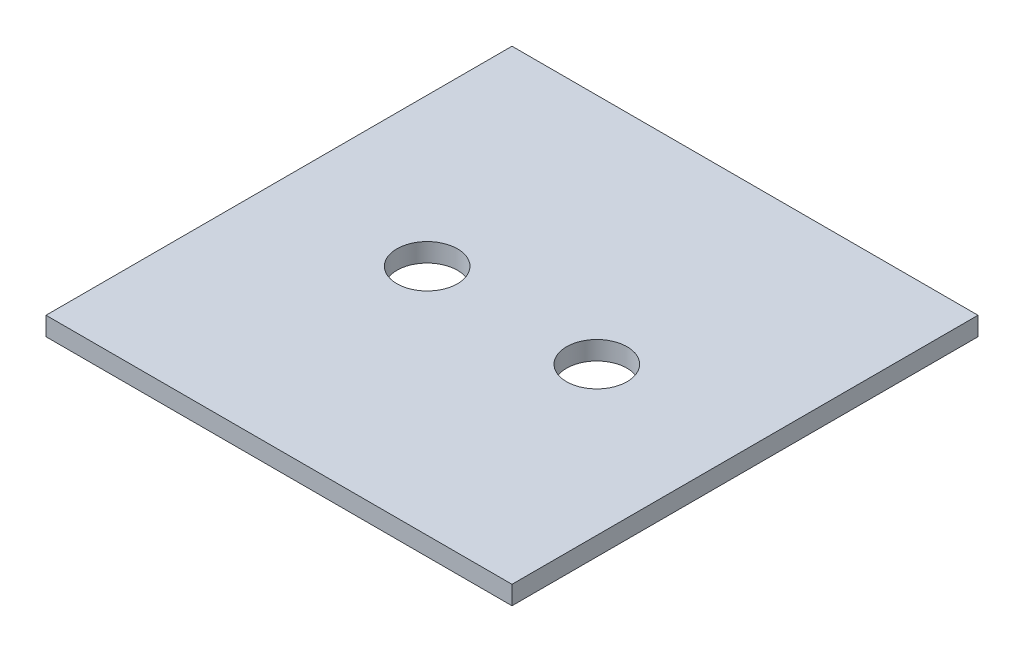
from build123d import *

# Parameters (mm, degrees)
SKETCH1_W           = 500
SKETCH1_H           = 500
BOSS_EXTRUDE1_DEPTH = 20
SKETCH2_R           = 32.5
CUT_EXTRUDE1_DEPTH  = 355.118624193


with BuildPart() as part:
    # Sketch1 → Boss-Extrude1 (new body)
    with BuildSketch(Plane(origin=(0, 0, 0), x_dir=(1, 0, 0), z_dir=(0, 1, 0))):
        Rectangle(SKETCH1_W, SKETCH1_H)
    extrude(amount=BOSS_EXTRUDE1_DEPTH)

    # Sketch2 → Cut-Extrude1 (cut, through all)
    with BuildSketch(Plane(origin=(0, 0, 0), x_dir=(1, 0, 0), z_dir=(0, 1, 0))):
        with Locations(Location((-91, 0, 0), (0, 0, 270))):
            Circle(SKETCH2_R)
        with Locations(Location((91, 0, 0), (0, 0, 270))):
            Circle(SKETCH2_R)
    extrude(amount=CUT_EXTRUDE1_DEPTH, mode=Mode.SUBTRACT)


solid = part.part
